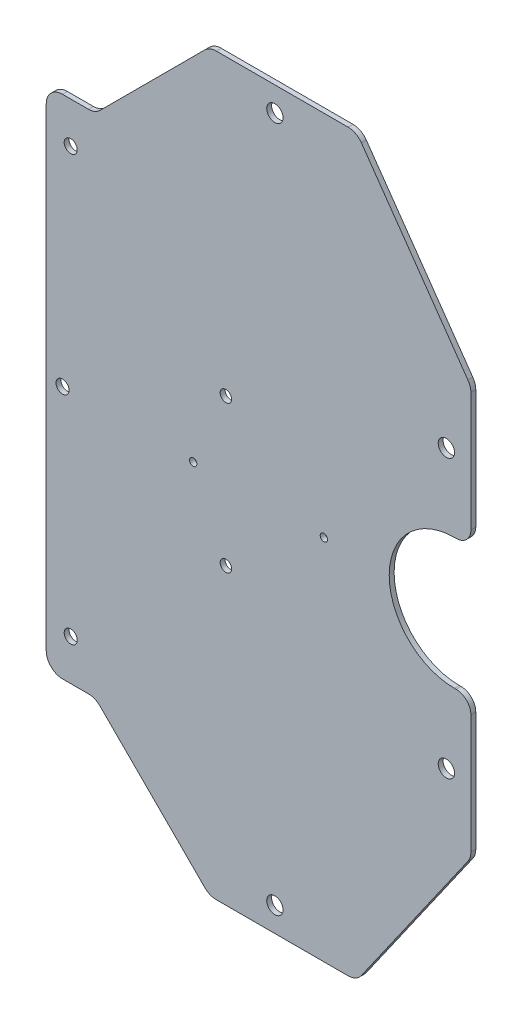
ISO-10303-21;
HEADER;
FILE_DESCRIPTION(('STEP AP214'),'2;1');
FILE_NAME('part.step','',(''),(''),'','','');
FILE_SCHEMA(('AUTOMOTIVE_DESIGN { 1 0 10303 214 1 1 1 1 }'));
ENDSEC;
DATA;
#1=APPLICATION_CONTEXT('core data for automotive mechanical design processes');
#2=APPLICATION_PROTOCOL_DEFINITION('international standard','automotive_design',2000,#1);
#3=PRODUCT_CONTEXT('',#1,'mechanical');
#4=PRODUCT('Part','Part','',(#3));
#5=PRODUCT_RELATED_PRODUCT_CATEGORY('part','',(#4));
#6=PRODUCT_DEFINITION_FORMATION('','',#4);
#7=PRODUCT_DEFINITION_CONTEXT('part definition',#1,'design');
#8=PRODUCT_DEFINITION('design','',#6,#7);
#9=PRODUCT_DEFINITION_SHAPE('','',#8);
#10=(LENGTH_UNIT() NAMED_UNIT(*) SI_UNIT(.MILLI.,.METRE.));
#11=(NAMED_UNIT(*) PLANE_ANGLE_UNIT() SI_UNIT($,.RADIAN.));
#12=(NAMED_UNIT(*) SI_UNIT($,.STERADIAN.) SOLID_ANGLE_UNIT());
#13=UNCERTAINTY_MEASURE_WITH_UNIT(LENGTH_MEASURE(1.E-05),#10,'distance_accuracy_value','');
#14=(GEOMETRIC_REPRESENTATION_CONTEXT(3) GLOBAL_UNCERTAINTY_ASSIGNED_CONTEXT((#13)) GLOBAL_UNIT_ASSIGNED_CONTEXT((#10,
#11,#12)) REPRESENTATION_CONTEXT('',''));
#15=CARTESIAN_POINT('',(0.,0.,0.));
#16=DIRECTION('',(0.,0.,1.));
#17=DIRECTION('',(1.,0.,0.));
#18=AXIS2_PLACEMENT_3D('',#15,#16,#17);
#19=CARTESIAN_POINT('',(-62.2065556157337,215.,3.));
#20=DIRECTION('',(0.,0.,1.));
#21=DIRECTION('',(1.,0.,0.));
#22=AXIS2_PLACEMENT_3D('',#19,#20,#21);
#23=PLANE('',#22);
#24=CARTESIAN_POINT('',(-157.,0.,3.));
#25=DIRECTION('',(0.,0.,1.));
#26=DIRECTION('',(1.,0.,0.));
#27=AXIS2_PLACEMENT_3D('',#24,#25,#26);
#28=CIRCLE('',#27,2.25000000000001);
#29=CARTESIAN_POINT('',(-154.75,0.,3.));
#30=VERTEX_POINT('',#29);
#31=EDGE_CURVE('E863',#30,#30,#28,.T.);
#32=ORIENTED_EDGE('',*,*,#31,.F.);
#33=EDGE_LOOP('',(#32));
#34=FACE_BOUND('',#33,.T.);
#35=CARTESIAN_POINT('',(-232.,130.,3.));
#36=DIRECTION('',(0.,0.,1.));
#37=DIRECTION('',(1.,0.,0.));
#38=AXIS2_PLACEMENT_3D('',#35,#36,#37);
#39=CIRCLE('',#38,3.99999999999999);
#40=CARTESIAN_POINT('',(-228.,130.,3.));
#41=VERTEX_POINT('',#40);
#42=EDGE_CURVE('E875',#41,#41,#39,.T.);
#43=ORIENTED_EDGE('',*,*,#42,.F.);
#44=EDGE_LOOP('',(#43));
#45=FACE_BOUND('',#44,.T.);
#46=CARTESIAN_POINT('',(-137.,45.,3.));
#47=DIRECTION('',(0.,0.,1.));
#48=DIRECTION('',(1.,0.,0.));
#49=AXIS2_PLACEMENT_3D('',#46,#47,#48);
#50=CIRCLE('',#49,3.49999999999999);
#51=CARTESIAN_POINT('',(-133.5,45.,3.));
#52=VERTEX_POINT('',#51);
#53=EDGE_CURVE('E887',#52,#52,#50,.T.);
#54=ORIENTED_EDGE('',*,*,#53,.F.);
#55=EDGE_LOOP('',(#54));
#56=FACE_BOUND('',#55,.T.);
#57=CARTESIAN_POINT('',(-1.99999999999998,-85.,3.));
#58=DIRECTION('',(0.,0.,1.));
#59=DIRECTION('',(1.,0.,0.));
#60=AXIS2_PLACEMENT_3D('',#57,#58,#59);
#61=CIRCLE('',#60,5.);
#62=CARTESIAN_POINT('',(3.00000000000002,-85.,3.));
#63=VERTEX_POINT('',#62);
#64=EDGE_CURVE('E899',#63,#63,#61,.T.);
#65=ORIENTED_EDGE('',*,*,#64,.F.);
#66=EDGE_LOOP('',(#65));
#67=FACE_BOUND('',#66,.T.);
#68=CARTESIAN_POINT('',(-107.,210.,3.));
#69=DIRECTION('',(0.,0.,1.));
#70=DIRECTION('',(1.,0.,0.));
#71=AXIS2_PLACEMENT_3D('',#68,#69,#70);
#72=CIRCLE('',#71,5.00000000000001);
#73=CARTESIAN_POINT('',(-102.,210.,3.));
#74=VERTEX_POINT('',#73);
#75=EDGE_CURVE('E911',#74,#74,#72,.T.);
#76=ORIENTED_EDGE('',*,*,#75,.F.);
#77=EDGE_LOOP('',(#76));
#78=FACE_BOUND('',#77,.T.);
#79=CARTESIAN_POINT('',(-62.2065556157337,215.,3.));
#80=DIRECTION('',(0.,0.,1.));
#81=DIRECTION('',(1.,0.,0.));
#82=AXIS2_PLACEMENT_3D('',#79,#80,#81);
#83=CIRCLE('',#82,10.);
#84=CARTESIAN_POINT('',(-54.0142364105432,220.734623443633,3.));
#85=VERTEX_POINT('',#84);
#86=CARTESIAN_POINT('',(-62.2065556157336,225.,3.));
#87=VERTEX_POINT('',#86);
#88=EDGE_CURVE('E294',#85,#87,#83,.T.);
#89=ORIENTED_EDGE('',*,*,#88,.T.);
#90=DIRECTION('',(1.,0.,0.));
#91=VECTOR('',#90,1.);
#92=CARTESIAN_POINT('',(-142.857864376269,225.,3.));
#93=LINE('',#92,#91);
#94=CARTESIAN_POINT('',(-142.857864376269,225.,3.));
#95=VERTEX_POINT('',#94);
#96=EDGE_CURVE('E211',#95,#87,#93,.T.);
#97=ORIENTED_EDGE('',*,*,#96,.F.);
#98=CARTESIAN_POINT('',(-142.857864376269,215.,3.));
#99=DIRECTION('',(0.,0.,1.));
#100=DIRECTION('',(1.,0.,0.));
#101=AXIS2_PLACEMENT_3D('',#98,#99,#100);
#102=CIRCLE('',#101,10.);
#103=CARTESIAN_POINT('',(-149.928932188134,222.071067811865,3.));
#104=VERTEX_POINT('',#103);
#105=EDGE_CURVE('E297',#95,#104,#102,.T.);
#106=ORIENTED_EDGE('',*,*,#105,.T.);
#107=DIRECTION('',(-0.707106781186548,-0.707106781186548,0.));
#108=VECTOR('',#107,1.);
#109=CARTESIAN_POINT('',(-149.928932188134,222.071067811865,3.));
#110=LINE('',#109,#108);
#111=CARTESIAN_POINT('',(-214.071067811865,157.928932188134,3.));
#112=VERTEX_POINT('',#111);
#113=EDGE_CURVE('E299',#104,#112,#110,.T.);
#114=ORIENTED_EDGE('',*,*,#113,.T.);
#115=CARTESIAN_POINT('',(-221.142135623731,165.,3.));
#116=DIRECTION('',(0.,0.,1.));
#117=DIRECTION('',(1.,0.,0.));
#118=AXIS2_PLACEMENT_3D('',#115,#116,#117);
#119=CIRCLE('',#118,10.);
#120=CARTESIAN_POINT('',(-221.142135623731,155.,3.));
#121=VERTEX_POINT('',#120);
#122=EDGE_CURVE('E301',#121,#112,#119,.T.);
#123=ORIENTED_EDGE('',*,*,#122,.F.);
#124=DIRECTION('',(-1.,0.,0.));
#125=VECTOR('',#124,1.);
#126=CARTESIAN_POINT('',(-221.142135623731,155.,3.));
#127=LINE('',#126,#125);
#128=CARTESIAN_POINT('',(-237.,155.,3.));
#129=VERTEX_POINT('',#128);
#130=EDGE_CURVE('E304',#121,#129,#127,.T.);
#131=ORIENTED_EDGE('',*,*,#130,.T.);
#132=CARTESIAN_POINT('',(-237.,145.,3.));
#133=DIRECTION('',(0.,0.,-1.));
#134=DIRECTION('',(-1.,0.,0.));
#135=AXIS2_PLACEMENT_3D('',#132,#133,#134);
#136=CIRCLE('',#135,10.);
#137=CARTESIAN_POINT('',(-247.,145.,3.));
#138=VERTEX_POINT('',#137);
#139=EDGE_CURVE('E306',#138,#129,#136,.T.);
#140=ORIENTED_EDGE('',*,*,#139,.F.);
#141=DIRECTION('',(0.,-1.,0.));
#142=VECTOR('',#141,1.);
#143=CARTESIAN_POINT('',(-247.,145.,3.));
#144=LINE('',#143,#142);
#145=CARTESIAN_POINT('',(-247.,-145.,3.));
#146=VERTEX_POINT('',#145);
#147=EDGE_CURVE('E309',#138,#146,#144,.T.);
#148=ORIENTED_EDGE('',*,*,#147,.T.);
#149=CARTESIAN_POINT('',(-237.,-145.,3.));
#150=DIRECTION('',(0.,0.,1.));
#151=DIRECTION('',(1.,0.,0.));
#152=AXIS2_PLACEMENT_3D('',#149,#150,#151);
#153=CIRCLE('',#152,10.);
#154=CARTESIAN_POINT('',(-237.,-155.,3.));
#155=VERTEX_POINT('',#154);
#156=EDGE_CURVE('E311',#146,#155,#153,.T.);
#157=ORIENTED_EDGE('',*,*,#156,.T.);
#158=DIRECTION('',(-1.,0.,0.));
#159=VECTOR('',#158,1.);
#160=CARTESIAN_POINT('',(-221.142135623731,-155.,3.));
#161=LINE('',#160,#159);
#162=CARTESIAN_POINT('',(-221.142135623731,-155.,3.));
#163=VERTEX_POINT('',#162);
#164=EDGE_CURVE('E313',#163,#155,#161,.T.);
#165=ORIENTED_EDGE('',*,*,#164,.F.);
#166=CARTESIAN_POINT('',(-221.142135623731,-165.,3.));
#167=DIRECTION('',(0.,0.,1.));
#168=DIRECTION('',(1.,0.,0.));
#169=AXIS2_PLACEMENT_3D('',#166,#167,#168);
#170=CIRCLE('',#169,10.);
#171=CARTESIAN_POINT('',(-214.071067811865,-157.928932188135,3.));
#172=VERTEX_POINT('',#171);
#173=EDGE_CURVE('E316',#172,#163,#170,.T.);
#174=ORIENTED_EDGE('',*,*,#173,.F.);
#175=DIRECTION('',(0.707106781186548,-0.707106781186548,0.));
#176=VECTOR('',#175,1.);
#177=CARTESIAN_POINT('',(-214.071067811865,-157.928932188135,3.));
#178=LINE('',#177,#176);
#179=CARTESIAN_POINT('',(-149.928932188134,-222.071067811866,3.));
#180=VERTEX_POINT('',#179);
#181=EDGE_CURVE('E319',#172,#180,#178,.T.);
#182=ORIENTED_EDGE('',*,*,#181,.T.);
#183=CARTESIAN_POINT('',(-142.857864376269,-215.,3.));
#184=DIRECTION('',(0.,0.,-1.));
#185=DIRECTION('',(-1.,0.,0.));
#186=AXIS2_PLACEMENT_3D('',#183,#184,#185);
#187=CIRCLE('',#186,9.99999999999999);
#188=CARTESIAN_POINT('',(-142.857864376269,-225.,3.));
#189=VERTEX_POINT('',#188);
#190=EDGE_CURVE('E321',#189,#180,#187,.T.);
#191=ORIENTED_EDGE('',*,*,#190,.F.);
#192=DIRECTION('',(1.,0.,0.));
#193=VECTOR('',#192,1.);
#194=CARTESIAN_POINT('',(-142.857864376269,-225.,3.));
#195=LINE('',#194,#193);
#196=CARTESIAN_POINT('',(-62.2065556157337,-225.,3.));
#197=VERTEX_POINT('',#196);
#198=EDGE_CURVE('E324',#189,#197,#195,.T.);
#199=ORIENTED_EDGE('',*,*,#198,.T.);
#200=CARTESIAN_POINT('',(-62.2065556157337,-215.,3.));
#201=DIRECTION('',(0.,0.,1.));
#202=DIRECTION('',(1.,0.,0.));
#203=AXIS2_PLACEMENT_3D('',#200,#201,#202);
#204=CIRCLE('',#203,9.99999999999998);
#205=CARTESIAN_POINT('',(-54.0142364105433,-220.734623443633,3.));
#206=VERTEX_POINT('',#205);
#207=EDGE_CURVE('E326',#197,#206,#204,.T.);
#208=ORIENTED_EDGE('',*,*,#207,.T.);
#209=DIRECTION('',(-0.573462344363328,-0.81923192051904,0.));
#210=VECTOR('',#209,1.);
#211=CARTESIAN_POINT('',(11.1923192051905,-127.582401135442,3.));
#212=LINE('',#211,#210);
#213=CARTESIAN_POINT('',(11.1923192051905,-127.582401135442,3.));
#214=VERTEX_POINT('',#213);
#215=EDGE_CURVE('E328',#214,#206,#212,.T.);
#216=ORIENTED_EDGE('',*,*,#215,.F.);
#217=CARTESIAN_POINT('',(3.00000000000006,-121.847777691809,3.));
#218=DIRECTION('',(0.,0.,1.));
#219=DIRECTION('',(1.,0.,0.));
#220=AXIS2_PLACEMENT_3D('',#217,#218,#219);
#221=CIRCLE('',#220,9.99999999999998);
#222=CARTESIAN_POINT('',(13.0000000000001,-121.847777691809,3.));
#223=VERTEX_POINT('',#222);
#224=EDGE_CURVE('E331',#214,#223,#221,.T.);
#225=ORIENTED_EDGE('',*,*,#224,.T.);
#226=DIRECTION('',(0.,-1.,0.));
#227=VECTOR('',#226,1.);
#228=CARTESIAN_POINT('',(13.0000000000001,-49.,3.));
#229=LINE('',#228,#227);
#230=CARTESIAN_POINT('',(13.0000000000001,-49.,3.));
#231=VERTEX_POINT('',#230);
#232=EDGE_CURVE('E333',#231,#223,#229,.T.);
#233=ORIENTED_EDGE('',*,*,#232,.F.);
#234=CARTESIAN_POINT('',(4.00000000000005,-49.,3.));
#235=DIRECTION('',(0.,0.,1.));
#236=DIRECTION('',(1.,0.,0.));
#237=AXIS2_PLACEMENT_3D('',#234,#235,#236);
#238=CIRCLE('',#237,9.);
#239=CARTESIAN_POINT('',(4.00000000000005,-40.,3.));
#240=VERTEX_POINT('',#239);
#241=EDGE_CURVE('E336',#231,#240,#238,.T.);
#242=ORIENTED_EDGE('',*,*,#241,.T.);
#243=DIRECTION('',(1.,0.,0.));
#244=VECTOR('',#243,1.);
#245=CARTESIAN_POINT('',(3.00000000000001,-40.,3.));
#246=LINE('',#245,#244);
#247=CARTESIAN_POINT('',(3.,-40.,3.));
#248=VERTEX_POINT('',#247);
#249=EDGE_CURVE('E338',#248,#240,#246,.T.);
#250=ORIENTED_EDGE('',*,*,#249,.F.);
#251=CARTESIAN_POINT('',(3.00000000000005,0.,3.));
#252=DIRECTION('',(0.,0.,1.));
#253=DIRECTION('',(1.,0.,0.));
#254=AXIS2_PLACEMENT_3D('',#251,#252,#253);
#255=CIRCLE('',#254,40.);
#256=CARTESIAN_POINT('',(3.00000000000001,40.,3.));
#257=VERTEX_POINT('',#256);
#258=EDGE_CURVE('E341',#257,#248,#255,.T.);
#259=ORIENTED_EDGE('',*,*,#258,.F.);
#260=DIRECTION('',(1.,0.,0.));
#261=VECTOR('',#260,1.);
#262=CARTESIAN_POINT('',(3.00000000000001,40.,3.));
#263=LINE('',#262,#261);
#264=CARTESIAN_POINT('',(4.00000000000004,40.,3.));
#265=VERTEX_POINT('',#264);
#266=EDGE_CURVE('E344',#257,#265,#263,.T.);
#267=ORIENTED_EDGE('',*,*,#266,.T.);
#268=CARTESIAN_POINT('',(4.00000000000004,49.,3.));
#269=DIRECTION('',(0.,0.,-1.));
#270=DIRECTION('',(-1.,0.,0.));
#271=AXIS2_PLACEMENT_3D('',#268,#269,#270);
#272=CIRCLE('',#271,9.);
#273=CARTESIAN_POINT('',(13.,49.,3.));
#274=VERTEX_POINT('',#273);
#275=EDGE_CURVE('E346',#274,#265,#272,.T.);
#276=ORIENTED_EDGE('',*,*,#275,.F.);
#277=DIRECTION('',(0.,-1.,0.));
#278=VECTOR('',#277,1.);
#279=CARTESIAN_POINT('',(13.0000000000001,121.847777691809,3.));
#280=LINE('',#279,#278);
#281=CARTESIAN_POINT('',(13.0000000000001,121.847777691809,3.));
#282=VERTEX_POINT('',#281);
#283=EDGE_CURVE('E349',#282,#274,#280,.T.);
#284=ORIENTED_EDGE('',*,*,#283,.F.);
#285=CARTESIAN_POINT('',(3.00000000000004,121.847777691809,3.));
#286=DIRECTION('',(0.,0.,1.));
#287=DIRECTION('',(1.,0.,0.));
#288=AXIS2_PLACEMENT_3D('',#285,#286,#287);
#289=CIRCLE('',#288,10.0000000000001);
#290=CARTESIAN_POINT('',(11.1923192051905,127.582401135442,3.));
#291=VERTEX_POINT('',#290);
#292=EDGE_CURVE('E53',#282,#291,#289,.T.);
#293=ORIENTED_EDGE('',*,*,#292,.T.);
#294=DIRECTION('',(0.573462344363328,-0.81923192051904,0.));
#295=VECTOR('',#294,1.);
#296=CARTESIAN_POINT('',(-54.0142364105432,220.734623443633,3.));
#297=LINE('',#296,#295);
#298=EDGE_CURVE('E353',#85,#291,#297,.T.);
#299=ORIENTED_EDGE('',*,*,#298,.F.);
#300=EDGE_LOOP('',(#89,#97,#106,#114,#123,#131,#140,#148,#157,#165,#174,#182,#191,#199,#208,
#216,#225,#233,#242,#250,#259,#267,#276,#284,#293,#299));
#301=FACE_BOUND('',#300,.T.);
#302=CARTESIAN_POINT('',(-232.,-130.,3.));
#303=DIRECTION('',(0.,0.,1.));
#304=DIRECTION('',(1.,0.,0.));
#305=AXIS2_PLACEMENT_3D('',#302,#303,#304);
#306=CIRCLE('',#305,3.99999999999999);
#307=CARTESIAN_POINT('',(-228.,-130.,3.));
#308=VERTEX_POINT('',#307);
#309=EDGE_CURVE('E217',#308,#308,#306,.T.);
#310=ORIENTED_EDGE('',*,*,#309,.F.);
#311=EDGE_LOOP('',(#310));
#312=FACE_BOUND('',#311,.T.);
#313=CARTESIAN_POINT('',(-107.,-210.,3.));
#314=DIRECTION('',(0.,0.,1.));
#315=DIRECTION('',(1.,0.,0.));
#316=AXIS2_PLACEMENT_3D('',#313,#314,#315);
#317=CIRCLE('',#316,5.00000000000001);
#318=CARTESIAN_POINT('',(-102.,-210.,3.));
#319=VERTEX_POINT('',#318);
#320=EDGE_CURVE('E905',#319,#319,#317,.T.);
#321=ORIENTED_EDGE('',*,*,#320,.F.);
#322=EDGE_LOOP('',(#321));
#323=FACE_BOUND('',#322,.T.);
#324=CARTESIAN_POINT('',(-1.99999999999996,85.,3.));
#325=DIRECTION('',(0.,0.,1.));
#326=DIRECTION('',(1.,0.,0.));
#327=AXIS2_PLACEMENT_3D('',#324,#325,#326);
#328=CIRCLE('',#327,5.);
#329=CARTESIAN_POINT('',(3.00000000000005,85.,3.));
#330=VERTEX_POINT('',#329);
#331=EDGE_CURVE('E893',#330,#330,#328,.T.);
#332=ORIENTED_EDGE('',*,*,#331,.F.);
#333=EDGE_LOOP('',(#332));
#334=FACE_BOUND('',#333,.T.);
#335=CARTESIAN_POINT('',(-137.,-45.,3.));
#336=DIRECTION('',(0.,0.,1.));
#337=DIRECTION('',(1.,0.,0.));
#338=AXIS2_PLACEMENT_3D('',#335,#336,#337);
#339=CIRCLE('',#338,3.49999999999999);
#340=CARTESIAN_POINT('',(-133.5,-45.,3.));
#341=VERTEX_POINT('',#340);
#342=EDGE_CURVE('E881',#341,#341,#339,.T.);
#343=ORIENTED_EDGE('',*,*,#342,.F.);
#344=EDGE_LOOP('',(#343));
#345=FACE_BOUND('',#344,.T.);
#346=CARTESIAN_POINT('',(-237.,0.,3.));
#347=DIRECTION('',(0.,0.,1.));
#348=DIRECTION('',(1.,0.,0.));
#349=AXIS2_PLACEMENT_3D('',#346,#347,#348);
#350=CIRCLE('',#349,3.99999999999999);
#351=CARTESIAN_POINT('',(-233.,0.,3.));
#352=VERTEX_POINT('',#351);
#353=EDGE_CURVE('E869',#352,#352,#350,.T.);
#354=ORIENTED_EDGE('',*,*,#353,.F.);
#355=EDGE_LOOP('',(#354));
#356=FACE_BOUND('',#355,.T.);
#357=CARTESIAN_POINT('',(-76.9999999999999,0.,3.));
#358=DIRECTION('',(0.,0.,1.));
#359=DIRECTION('',(1.,0.,0.));
#360=AXIS2_PLACEMENT_3D('',#357,#358,#359);
#361=CIRCLE('',#360,2.25);
#362=CARTESIAN_POINT('',(-74.7499999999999,0.,3.));
#363=VERTEX_POINT('',#362);
#364=EDGE_CURVE('E852',#363,#363,#361,.T.);
#365=ORIENTED_EDGE('',*,*,#364,.F.);
#366=EDGE_LOOP('',(#365));
#367=FACE_BOUND('',#366,.T.);
#368=ADVANCED_FACE('F30',(#34,#45,#56,#67,#78,#301,#312,#323,#334,#345,#356,#367),#23,.T.);
#369=CARTESIAN_POINT('',(-62.2065556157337,215.,0.));
#370=DIRECTION('',(0.,0.,1.));
#371=DIRECTION('',(1.,0.,0.));
#372=AXIS2_PLACEMENT_3D('',#369,#370,#371);
#373=PLANE('',#372);
#374=CARTESIAN_POINT('',(-157.,0.,0.));
#375=DIRECTION('',(0.,0.,1.));
#376=DIRECTION('',(1.,0.,0.));
#377=AXIS2_PLACEMENT_3D('',#374,#375,#376);
#378=CIRCLE('',#377,2.25000000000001);
#379=CARTESIAN_POINT('',(-154.75,0.,0.));
#380=VERTEX_POINT('',#379);
#381=EDGE_CURVE('E858',#380,#380,#378,.T.);
#382=ORIENTED_EDGE('',*,*,#381,.T.);
#383=EDGE_LOOP('',(#382));
#384=FACE_BOUND('',#383,.T.);
#385=CARTESIAN_POINT('',(-232.,130.,0.));
#386=DIRECTION('',(0.,0.,1.));
#387=DIRECTION('',(1.,0.,0.));
#388=AXIS2_PLACEMENT_3D('',#385,#386,#387);
#389=CIRCLE('',#388,3.99999999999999);
#390=CARTESIAN_POINT('',(-228.,130.,0.));
#391=VERTEX_POINT('',#390);
#392=EDGE_CURVE('E872',#391,#391,#389,.T.);
#393=ORIENTED_EDGE('',*,*,#392,.T.);
#394=EDGE_LOOP('',(#393));
#395=FACE_BOUND('',#394,.T.);
#396=CARTESIAN_POINT('',(-137.,45.,0.));
#397=DIRECTION('',(0.,0.,1.));
#398=DIRECTION('',(1.,0.,0.));
#399=AXIS2_PLACEMENT_3D('',#396,#397,#398);
#400=CIRCLE('',#399,3.49999999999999);
#401=CARTESIAN_POINT('',(-133.5,45.,0.));
#402=VERTEX_POINT('',#401);
#403=EDGE_CURVE('E884',#402,#402,#400,.T.);
#404=ORIENTED_EDGE('',*,*,#403,.T.);
#405=EDGE_LOOP('',(#404));
#406=FACE_BOUND('',#405,.T.);
#407=CARTESIAN_POINT('',(-1.99999999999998,-85.,0.));
#408=DIRECTION('',(0.,0.,1.));
#409=DIRECTION('',(1.,0.,0.));
#410=AXIS2_PLACEMENT_3D('',#407,#408,#409);
#411=CIRCLE('',#410,5.);
#412=CARTESIAN_POINT('',(3.00000000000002,-85.,0.));
#413=VERTEX_POINT('',#412);
#414=EDGE_CURVE('E896',#413,#413,#411,.T.);
#415=ORIENTED_EDGE('',*,*,#414,.T.);
#416=EDGE_LOOP('',(#415));
#417=FACE_BOUND('',#416,.T.);
#418=CARTESIAN_POINT('',(-107.,210.,0.));
#419=DIRECTION('',(0.,0.,1.));
#420=DIRECTION('',(1.,0.,0.));
#421=AXIS2_PLACEMENT_3D('',#418,#419,#420);
#422=CIRCLE('',#421,5.00000000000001);
#423=CARTESIAN_POINT('',(-102.,210.,0.));
#424=VERTEX_POINT('',#423);
#425=EDGE_CURVE('E908',#424,#424,#422,.T.);
#426=ORIENTED_EDGE('',*,*,#425,.T.);
#427=EDGE_LOOP('',(#426));
#428=FACE_BOUND('',#427,.T.);
#429=CARTESIAN_POINT('',(-62.2065556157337,215.,0.));
#430=DIRECTION('',(0.,0.,1.));
#431=DIRECTION('',(1.,0.,0.));
#432=AXIS2_PLACEMENT_3D('',#429,#430,#431);
#433=CIRCLE('',#432,10.);
#434=CARTESIAN_POINT('',(-54.0142364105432,220.734623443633,0.));
#435=VERTEX_POINT('',#434);
#436=CARTESIAN_POINT('',(-62.2065556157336,225.,0.));
#437=VERTEX_POINT('',#436);
#438=EDGE_CURVE('E214',#435,#437,#433,.T.);
#439=ORIENTED_EDGE('',*,*,#438,.F.);
#440=DIRECTION('',(0.573462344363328,-0.81923192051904,0.));
#441=VECTOR('',#440,1.);
#442=CARTESIAN_POINT('',(-54.0142364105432,220.734623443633,0.));
#443=LINE('',#442,#441);
#444=CARTESIAN_POINT('',(11.1923192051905,127.582401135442,0.));
#445=VERTEX_POINT('',#444);
#446=EDGE_CURVE('E292',#435,#445,#443,.T.);
#447=ORIENTED_EDGE('',*,*,#446,.T.);
#448=CARTESIAN_POINT('',(3.00000000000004,121.847777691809,0.));
#449=DIRECTION('',(0.,0.,1.));
#450=DIRECTION('',(1.,0.,0.));
#451=AXIS2_PLACEMENT_3D('',#448,#449,#450);
#452=CIRCLE('',#451,10.0000000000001);
#453=CARTESIAN_POINT('',(13.0000000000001,121.847777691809,0.));
#454=VERTEX_POINT('',#453);
#455=EDGE_CURVE('E289',#454,#445,#452,.T.);
#456=ORIENTED_EDGE('',*,*,#455,.F.);
#457=DIRECTION('',(0.,-1.,0.));
#458=VECTOR('',#457,1.);
#459=CARTESIAN_POINT('',(13.0000000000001,121.847777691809,0.));
#460=LINE('',#459,#458);
#461=CARTESIAN_POINT('',(13.,49.,0.));
#462=VERTEX_POINT('',#461);
#463=EDGE_CURVE('E286',#454,#462,#460,.T.);
#464=ORIENTED_EDGE('',*,*,#463,.T.);
#465=CARTESIAN_POINT('',(4.00000000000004,49.,0.));
#466=DIRECTION('',(0.,0.,-1.));
#467=DIRECTION('',(-1.,0.,0.));
#468=AXIS2_PLACEMENT_3D('',#465,#466,#467);
#469=CIRCLE('',#468,9.);
#470=CARTESIAN_POINT('',(4.00000000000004,40.,0.));
#471=VERTEX_POINT('',#470);
#472=EDGE_CURVE('E283',#462,#471,#469,.T.);
#473=ORIENTED_EDGE('',*,*,#472,.T.);
#474=DIRECTION('',(1.,0.,0.));
#475=VECTOR('',#474,1.);
#476=CARTESIAN_POINT('',(3.00000000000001,40.,0.));
#477=LINE('',#476,#475);
#478=CARTESIAN_POINT('',(3.00000000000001,40.,0.));
#479=VERTEX_POINT('',#478);
#480=EDGE_CURVE('E280',#479,#471,#477,.T.);
#481=ORIENTED_EDGE('',*,*,#480,.F.);
#482=CARTESIAN_POINT('',(3.00000000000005,0.,0.));
#483=DIRECTION('',(0.,0.,1.));
#484=DIRECTION('',(1.,0.,0.));
#485=AXIS2_PLACEMENT_3D('',#482,#483,#484);
#486=CIRCLE('',#485,40.);
#487=CARTESIAN_POINT('',(3.,-40.,0.));
#488=VERTEX_POINT('',#487);
#489=EDGE_CURVE('E277',#479,#488,#486,.T.);
#490=ORIENTED_EDGE('',*,*,#489,.T.);
#491=DIRECTION('',(1.,0.,0.));
#492=VECTOR('',#491,1.);
#493=CARTESIAN_POINT('',(3.00000000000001,-40.,0.));
#494=LINE('',#493,#492);
#495=CARTESIAN_POINT('',(4.00000000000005,-40.,0.));
#496=VERTEX_POINT('',#495);
#497=EDGE_CURVE('E274',#488,#496,#494,.T.);
#498=ORIENTED_EDGE('',*,*,#497,.T.);
#499=CARTESIAN_POINT('',(4.00000000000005,-49.,0.));
#500=DIRECTION('',(0.,0.,1.));
#501=DIRECTION('',(1.,0.,0.));
#502=AXIS2_PLACEMENT_3D('',#499,#500,#501);
#503=CIRCLE('',#502,9.);
#504=CARTESIAN_POINT('',(13.0000000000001,-49.,0.));
#505=VERTEX_POINT('',#504);
#506=EDGE_CURVE('E271',#505,#496,#503,.T.);
#507=ORIENTED_EDGE('',*,*,#506,.F.);
#508=DIRECTION('',(0.,-1.,0.));
#509=VECTOR('',#508,1.);
#510=CARTESIAN_POINT('',(13.0000000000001,-49.,0.));
#511=LINE('',#510,#509);
#512=CARTESIAN_POINT('',(13.0000000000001,-121.847777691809,0.));
#513=VERTEX_POINT('',#512);
#514=EDGE_CURVE('E268',#505,#513,#511,.T.);
#515=ORIENTED_EDGE('',*,*,#514,.T.);
#516=CARTESIAN_POINT('',(3.00000000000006,-121.847777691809,0.));
#517=DIRECTION('',(0.,0.,1.));
#518=DIRECTION('',(1.,0.,0.));
#519=AXIS2_PLACEMENT_3D('',#516,#517,#518);
#520=CIRCLE('',#519,9.99999999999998);
#521=CARTESIAN_POINT('',(11.1923192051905,-127.582401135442,0.));
#522=VERTEX_POINT('',#521);
#523=EDGE_CURVE('E265',#522,#513,#520,.T.);
#524=ORIENTED_EDGE('',*,*,#523,.F.);
#525=DIRECTION('',(-0.573462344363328,-0.81923192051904,0.));
#526=VECTOR('',#525,1.);
#527=CARTESIAN_POINT('',(11.1923192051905,-127.582401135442,0.));
#528=LINE('',#527,#526);
#529=CARTESIAN_POINT('',(-54.0142364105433,-220.734623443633,0.));
#530=VERTEX_POINT('',#529);
#531=EDGE_CURVE('E262',#522,#530,#528,.T.);
#532=ORIENTED_EDGE('',*,*,#531,.T.);
#533=CARTESIAN_POINT('',(-62.2065556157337,-215.,0.));
#534=DIRECTION('',(0.,0.,1.));
#535=DIRECTION('',(1.,0.,0.));
#536=AXIS2_PLACEMENT_3D('',#533,#534,#535);
#537=CIRCLE('',#536,9.99999999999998);
#538=CARTESIAN_POINT('',(-62.2065556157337,-225.,0.));
#539=VERTEX_POINT('',#538);
#540=EDGE_CURVE('E259',#539,#530,#537,.T.);
#541=ORIENTED_EDGE('',*,*,#540,.F.);
#542=DIRECTION('',(1.,0.,0.));
#543=VECTOR('',#542,1.);
#544=CARTESIAN_POINT('',(-142.857864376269,-225.,0.));
#545=LINE('',#544,#543);
#546=CARTESIAN_POINT('',(-142.857864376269,-225.,0.));
#547=VERTEX_POINT('',#546);
#548=EDGE_CURVE('E257',#547,#539,#545,.T.);
#549=ORIENTED_EDGE('',*,*,#548,.F.);
#550=CARTESIAN_POINT('',(-142.857864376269,-215.,0.));
#551=DIRECTION('',(0.,0.,-1.));
#552=DIRECTION('',(-1.,0.,0.));
#553=AXIS2_PLACEMENT_3D('',#550,#551,#552);
#554=CIRCLE('',#553,9.99999999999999);
#555=CARTESIAN_POINT('',(-149.928932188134,-222.071067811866,0.));
#556=VERTEX_POINT('',#555);
#557=EDGE_CURVE('E254',#547,#556,#554,.T.);
#558=ORIENTED_EDGE('',*,*,#557,.T.);
#559=DIRECTION('',(0.707106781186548,-0.707106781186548,0.));
#560=VECTOR('',#559,1.);
#561=CARTESIAN_POINT('',(-214.071067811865,-157.928932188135,0.));
#562=LINE('',#561,#560);
#563=CARTESIAN_POINT('',(-214.071067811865,-157.928932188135,0.));
#564=VERTEX_POINT('',#563);
#565=EDGE_CURVE('E251',#564,#556,#562,.T.);
#566=ORIENTED_EDGE('',*,*,#565,.F.);
#567=CARTESIAN_POINT('',(-221.142135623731,-165.,0.));
#568=DIRECTION('',(0.,0.,1.));
#569=DIRECTION('',(1.,0.,0.));
#570=AXIS2_PLACEMENT_3D('',#567,#568,#569);
#571=CIRCLE('',#570,10.);
#572=CARTESIAN_POINT('',(-221.142135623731,-155.,0.));
#573=VERTEX_POINT('',#572);
#574=EDGE_CURVE('E248',#564,#573,#571,.T.);
#575=ORIENTED_EDGE('',*,*,#574,.T.);
#576=DIRECTION('',(-1.,0.,0.));
#577=VECTOR('',#576,1.);
#578=CARTESIAN_POINT('',(-221.142135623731,-155.,0.));
#579=LINE('',#578,#577);
#580=CARTESIAN_POINT('',(-237.,-155.,0.));
#581=VERTEX_POINT('',#580);
#582=EDGE_CURVE('E245',#573,#581,#579,.T.);
#583=ORIENTED_EDGE('',*,*,#582,.T.);
#584=CARTESIAN_POINT('',(-237.,-145.,0.));
#585=DIRECTION('',(0.,0.,1.));
#586=DIRECTION('',(1.,0.,0.));
#587=AXIS2_PLACEMENT_3D('',#584,#585,#586);
#588=CIRCLE('',#587,10.);
#589=CARTESIAN_POINT('',(-247.,-145.,0.));
#590=VERTEX_POINT('',#589);
#591=EDGE_CURVE('E242',#590,#581,#588,.T.);
#592=ORIENTED_EDGE('',*,*,#591,.F.);
#593=DIRECTION('',(0.,1.,0.));
#594=VECTOR('',#593,1.);
#595=CARTESIAN_POINT('',(-247.,-145.,0.));
#596=LINE('',#595,#594);
#597=CARTESIAN_POINT('',(-247.,145.,0.));
#598=VERTEX_POINT('',#597);
#599=EDGE_CURVE('E240',#590,#598,#596,.T.);
#600=ORIENTED_EDGE('',*,*,#599,.T.);
#601=CARTESIAN_POINT('',(-237.,145.,0.));
#602=DIRECTION('',(0.,0.,-1.));
#603=DIRECTION('',(-1.,0.,0.));
#604=AXIS2_PLACEMENT_3D('',#601,#602,#603);
#605=CIRCLE('',#604,10.);
#606=CARTESIAN_POINT('',(-237.,155.,0.));
#607=VERTEX_POINT('',#606);
#608=EDGE_CURVE('E237',#598,#607,#605,.T.);
#609=ORIENTED_EDGE('',*,*,#608,.T.);
#610=DIRECTION('',(-1.,0.,0.));
#611=VECTOR('',#610,1.);
#612=CARTESIAN_POINT('',(-221.142135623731,155.,0.));
#613=LINE('',#612,#611);
#614=CARTESIAN_POINT('',(-221.142135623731,155.,0.));
#615=VERTEX_POINT('',#614);
#616=EDGE_CURVE('E234',#615,#607,#613,.T.);
#617=ORIENTED_EDGE('',*,*,#616,.F.);
#618=CARTESIAN_POINT('',(-221.142135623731,165.,0.));
#619=DIRECTION('',(0.,0.,1.));
#620=DIRECTION('',(1.,0.,0.));
#621=AXIS2_PLACEMENT_3D('',#618,#619,#620);
#622=CIRCLE('',#621,10.);
#623=CARTESIAN_POINT('',(-214.071067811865,157.928932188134,0.));
#624=VERTEX_POINT('',#623);
#625=EDGE_CURVE('E231',#615,#624,#622,.T.);
#626=ORIENTED_EDGE('',*,*,#625,.T.);
#627=DIRECTION('',(-0.707106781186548,-0.707106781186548,0.));
#628=VECTOR('',#627,1.);
#629=CARTESIAN_POINT('',(-149.928932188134,222.071067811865,0.));
#630=LINE('',#629,#628);
#631=CARTESIAN_POINT('',(-149.928932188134,222.071067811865,0.));
#632=VERTEX_POINT('',#631);
#633=EDGE_CURVE('E225',#632,#624,#630,.T.);
#634=ORIENTED_EDGE('',*,*,#633,.F.);
#635=CARTESIAN_POINT('',(-142.857864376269,215.,0.));
#636=DIRECTION('',(0.,0.,1.));
#637=DIRECTION('',(1.,0.,0.));
#638=AXIS2_PLACEMENT_3D('',#635,#636,#637);
#639=CIRCLE('',#638,10.);
#640=CARTESIAN_POINT('',(-142.857864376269,225.,0.));
#641=VERTEX_POINT('',#640);
#642=EDGE_CURVE('E223',#641,#632,#639,.T.);
#643=ORIENTED_EDGE('',*,*,#642,.F.);
#644=DIRECTION('',(1.,0.,0.));
#645=VECTOR('',#644,1.);
#646=CARTESIAN_POINT('',(-142.857864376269,225.,0.));
#647=LINE('',#646,#645);
#648=EDGE_CURVE('E209',#641,#437,#647,.T.);
#649=ORIENTED_EDGE('',*,*,#648,.T.);
#650=EDGE_LOOP('',(#439,#447,#456,#464,#473,#481,#490,#498,#507,#515,#524,#532,#541,#549,#558,
#566,#575,#583,#592,#600,#609,#617,#626,#634,#643,#649));
#651=FACE_BOUND('',#650,.T.);
#652=CARTESIAN_POINT('',(-232.,-130.,0.));
#653=DIRECTION('',(0.,0.,1.));
#654=DIRECTION('',(1.,0.,0.));
#655=AXIS2_PLACEMENT_3D('',#652,#653,#654);
#656=CIRCLE('',#655,3.99999999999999);
#657=CARTESIAN_POINT('',(-228.,-130.,0.));
#658=VERTEX_POINT('',#657);
#659=EDGE_CURVE('E914',#658,#658,#656,.T.);
#660=ORIENTED_EDGE('',*,*,#659,.T.);
#661=EDGE_LOOP('',(#660));
#662=FACE_BOUND('',#661,.T.);
#663=CARTESIAN_POINT('',(-107.,-210.,0.));
#664=DIRECTION('',(0.,0.,1.));
#665=DIRECTION('',(1.,0.,0.));
#666=AXIS2_PLACEMENT_3D('',#663,#664,#665);
#667=CIRCLE('',#666,5.00000000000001);
#668=CARTESIAN_POINT('',(-102.,-210.,0.));
#669=VERTEX_POINT('',#668);
#670=EDGE_CURVE('E902',#669,#669,#667,.T.);
#671=ORIENTED_EDGE('',*,*,#670,.T.);
#672=EDGE_LOOP('',(#671));
#673=FACE_BOUND('',#672,.T.);
#674=CARTESIAN_POINT('',(-1.99999999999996,85.,0.));
#675=DIRECTION('',(0.,0.,1.));
#676=DIRECTION('',(1.,0.,0.));
#677=AXIS2_PLACEMENT_3D('',#674,#675,#676);
#678=CIRCLE('',#677,5.);
#679=CARTESIAN_POINT('',(3.00000000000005,85.,0.));
#680=VERTEX_POINT('',#679);
#681=EDGE_CURVE('E890',#680,#680,#678,.T.);
#682=ORIENTED_EDGE('',*,*,#681,.T.);
#683=EDGE_LOOP('',(#682));
#684=FACE_BOUND('',#683,.T.);
#685=CARTESIAN_POINT('',(-137.,-45.,0.));
#686=DIRECTION('',(0.,0.,1.));
#687=DIRECTION('',(1.,0.,0.));
#688=AXIS2_PLACEMENT_3D('',#685,#686,#687);
#689=CIRCLE('',#688,3.49999999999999);
#690=CARTESIAN_POINT('',(-133.5,-45.,0.));
#691=VERTEX_POINT('',#690);
#692=EDGE_CURVE('E878',#691,#691,#689,.T.);
#693=ORIENTED_EDGE('',*,*,#692,.T.);
#694=EDGE_LOOP('',(#693));
#695=FACE_BOUND('',#694,.T.);
#696=CARTESIAN_POINT('',(-237.,0.,0.));
#697=DIRECTION('',(0.,0.,1.));
#698=DIRECTION('',(1.,0.,0.));
#699=AXIS2_PLACEMENT_3D('',#696,#697,#698);
#700=CIRCLE('',#699,3.99999999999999);
#701=CARTESIAN_POINT('',(-233.,0.,0.));
#702=VERTEX_POINT('',#701);
#703=EDGE_CURVE('E866',#702,#702,#700,.T.);
#704=ORIENTED_EDGE('',*,*,#703,.T.);
#705=EDGE_LOOP('',(#704));
#706=FACE_BOUND('',#705,.T.);
#707=CARTESIAN_POINT('',(-76.9999999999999,0.,0.));
#708=DIRECTION('',(0.,0.,1.));
#709=DIRECTION('',(1.,0.,0.));
#710=AXIS2_PLACEMENT_3D('',#707,#708,#709);
#711=CIRCLE('',#710,2.25);
#712=CARTESIAN_POINT('',(-74.7499999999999,0.,0.));
#713=VERTEX_POINT('',#712);
#714=EDGE_CURVE('E855',#713,#713,#711,.T.);
#715=ORIENTED_EDGE('',*,*,#714,.T.);
#716=EDGE_LOOP('',(#715));
#717=FACE_BOUND('',#716,.T.);
#718=ADVANCED_FACE('F220',(#384,#395,#406,#417,#428,#651,#662,#673,#684,#695,#706,#717),#373,.F.);
#719=CARTESIAN_POINT('',(-62.2065556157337,215.,3.));
#720=DIRECTION('',(0.,0.,-1.));
#721=DIRECTION('',(-1.,0.,0.));
#722=AXIS2_PLACEMENT_3D('',#719,#720,#721);
#723=CYLINDRICAL_SURFACE('',#722,10.);
#724=ORIENTED_EDGE('',*,*,#438,.T.);
#725=DIRECTION('',(0.,0.,-1.));
#726=VECTOR('',#725,1.);
#727=CARTESIAN_POINT('',(-62.2065556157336,225.,3.));
#728=LINE('',#727,#726);
#729=EDGE_CURVE('E11',#87,#437,#728,.T.);
#730=ORIENTED_EDGE('',*,*,#729,.F.);
#731=ORIENTED_EDGE('',*,*,#88,.F.);
#732=DIRECTION('',(0.,0.,-1.));
#733=VECTOR('',#732,1.);
#734=CARTESIAN_POINT('',(-54.0142364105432,220.734623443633,3.));
#735=LINE('',#734,#733);
#736=EDGE_CURVE('E45',#85,#435,#735,.T.);
#737=ORIENTED_EDGE('',*,*,#736,.T.);
#738=EDGE_LOOP('',(#724,#730,#731,#737));
#739=FACE_BOUND('',#738,.T.);
#740=ADVANCED_FACE('F32',(#739),#723,.T.);
#741=CARTESIAN_POINT('',(-142.857864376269,225.,3.));
#742=DIRECTION('',(0.,1.,0.));
#743=DIRECTION('',(0.,0.,1.));
#744=AXIS2_PLACEMENT_3D('',#741,#742,#743);
#745=PLANE('',#744);
#746=ORIENTED_EDGE('',*,*,#648,.F.);
#747=DIRECTION('',(0.,0.,-1.));
#748=VECTOR('',#747,1.);
#749=CARTESIAN_POINT('',(-142.857864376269,225.,3.));
#750=LINE('',#749,#748);
#751=EDGE_CURVE('E38',#95,#641,#750,.T.);
#752=ORIENTED_EDGE('',*,*,#751,.F.);
#753=ORIENTED_EDGE('',*,*,#96,.T.);
#754=ORIENTED_EDGE('',*,*,#729,.T.);
#755=EDGE_LOOP('',(#746,#752,#753,#754));
#756=FACE_BOUND('',#755,.T.);
#757=ADVANCED_FACE('F207',(#756),#745,.T.);
#758=CARTESIAN_POINT('',(-142.857864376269,215.,3.));
#759=DIRECTION('',(0.,0.,-1.));
#760=DIRECTION('',(-1.,0.,0.));
#761=AXIS2_PLACEMENT_3D('',#758,#759,#760);
#762=CYLINDRICAL_SURFACE('',#761,10.);
#763=ORIENTED_EDGE('',*,*,#642,.T.);
#764=DIRECTION('',(0.,0.,-1.));
#765=VECTOR('',#764,1.);
#766=CARTESIAN_POINT('',(-149.928932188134,222.071067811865,3.));
#767=LINE('',#766,#765);
#768=EDGE_CURVE('E402',#104,#632,#767,.T.);
#769=ORIENTED_EDGE('',*,*,#768,.F.);
#770=ORIENTED_EDGE('',*,*,#105,.F.);
#771=ORIENTED_EDGE('',*,*,#751,.T.);
#772=EDGE_LOOP('',(#763,#769,#770,#771));
#773=FACE_BOUND('',#772,.T.);
#774=ADVANCED_FACE('F406',(#773),#762,.T.);
#775=CARTESIAN_POINT('',(-149.928932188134,222.071067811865,3.));
#776=DIRECTION('',(0.707106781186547,-0.707106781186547,0.));
#777=DIRECTION('',(0.707106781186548,0.707106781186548,0.));
#778=AXIS2_PLACEMENT_3D('',#775,#776,#777);
#779=PLANE('',#778);
#780=ORIENTED_EDGE('',*,*,#633,.T.);
#781=DIRECTION('',(0.,0.,-1.));
#782=VECTOR('',#781,1.);
#783=CARTESIAN_POINT('',(-214.071067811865,157.928932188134,3.));
#784=LINE('',#783,#782);
#785=EDGE_CURVE('E400',#112,#624,#784,.T.);
#786=ORIENTED_EDGE('',*,*,#785,.F.);
#787=ORIENTED_EDGE('',*,*,#113,.F.);
#788=ORIENTED_EDGE('',*,*,#768,.T.);
#789=EDGE_LOOP('',(#780,#786,#787,#788));
#790=FACE_BOUND('',#789,.T.);
#791=ADVANCED_FACE('F499',(#790),#779,.F.);
#792=CARTESIAN_POINT('',(-221.142135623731,165.,3.));
#793=DIRECTION('',(0.,0.,-1.));
#794=DIRECTION('',(-1.,0.,0.));
#795=AXIS2_PLACEMENT_3D('',#792,#793,#794);
#796=CYLINDRICAL_SURFACE('',#795,10.);
#797=ORIENTED_EDGE('',*,*,#625,.F.);
#798=DIRECTION('',(0.,0.,-1.));
#799=VECTOR('',#798,1.);
#800=CARTESIAN_POINT('',(-221.142135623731,155.,3.));
#801=LINE('',#800,#799);
#802=EDGE_CURVE('E398',#121,#615,#801,.T.);
#803=ORIENTED_EDGE('',*,*,#802,.F.);
#804=ORIENTED_EDGE('',*,*,#122,.T.);
#805=ORIENTED_EDGE('',*,*,#785,.T.);
#806=EDGE_LOOP('',(#797,#803,#804,#805));
#807=FACE_BOUND('',#806,.T.);
#808=ADVANCED_FACE('F494',(#807),#796,.F.);
#809=CARTESIAN_POINT('',(-221.142135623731,155.,3.));
#810=DIRECTION('',(0.,-1.,0.));
#811=DIRECTION('',(0.,0.,-1.));
#812=AXIS2_PLACEMENT_3D('',#809,#810,#811);
#813=PLANE('',#812);
#814=ORIENTED_EDGE('',*,*,#616,.T.);
#815=DIRECTION('',(0.,0.,-1.));
#816=VECTOR('',#815,1.);
#817=CARTESIAN_POINT('',(-237.,155.,3.));
#818=LINE('',#817,#816);
#819=EDGE_CURVE('E396',#129,#607,#818,.T.);
#820=ORIENTED_EDGE('',*,*,#819,.F.);
#821=ORIENTED_EDGE('',*,*,#130,.F.);
#822=ORIENTED_EDGE('',*,*,#802,.T.);
#823=EDGE_LOOP('',(#814,#820,#821,#822));
#824=FACE_BOUND('',#823,.T.);
#825=ADVANCED_FACE('F500',(#824),#813,.F.);
#826=CARTESIAN_POINT('',(-237.,145.,3.));
#827=DIRECTION('',(0.,0.,-1.));
#828=DIRECTION('',(-1.,0.,0.));
#829=AXIS2_PLACEMENT_3D('',#826,#827,#828);
#830=CYLINDRICAL_SURFACE('',#829,10.);
#831=ORIENTED_EDGE('',*,*,#608,.F.);
#832=DIRECTION('',(0.,0.,-1.));
#833=VECTOR('',#832,1.);
#834=CARTESIAN_POINT('',(-247.,145.,3.));
#835=LINE('',#834,#833);
#836=EDGE_CURVE('E393',#138,#598,#835,.T.);
#837=ORIENTED_EDGE('',*,*,#836,.F.);
#838=ORIENTED_EDGE('',*,*,#139,.T.);
#839=ORIENTED_EDGE('',*,*,#819,.T.);
#840=EDGE_LOOP('',(#831,#837,#838,#839));
#841=FACE_BOUND('',#840,.T.);
#842=ADVANCED_FACE('F488',(#841),#830,.T.);
#843=CARTESIAN_POINT('',(-247.,-145.,3.));
#844=DIRECTION('',(-1.,0.,0.));
#845=DIRECTION('',(0.,0.,1.));
#846=AXIS2_PLACEMENT_3D('',#843,#844,#845);
#847=PLANE('',#846);
#848=ORIENTED_EDGE('',*,*,#599,.F.);
#849=DIRECTION('',(0.,0.,-1.));
#850=VECTOR('',#849,1.);
#851=CARTESIAN_POINT('',(-247.,-145.,3.));
#852=LINE('',#851,#850);
#853=EDGE_CURVE('E391',#146,#590,#852,.T.);
#854=ORIENTED_EDGE('',*,*,#853,.F.);
#855=ORIENTED_EDGE('',*,*,#147,.F.);
#856=ORIENTED_EDGE('',*,*,#836,.T.);
#857=EDGE_LOOP('',(#848,#854,#855,#856));
#858=FACE_BOUND('',#857,.T.);
#859=ADVANCED_FACE('F482',(#858),#847,.T.);
#860=CARTESIAN_POINT('',(-237.,-145.,3.));
#861=DIRECTION('',(0.,0.,-1.));
#862=DIRECTION('',(-1.,0.,0.));
#863=AXIS2_PLACEMENT_3D('',#860,#861,#862);
#864=CYLINDRICAL_SURFACE('',#863,10.);
#865=ORIENTED_EDGE('',*,*,#591,.T.);
#866=DIRECTION('',(0.,0.,-1.));
#867=VECTOR('',#866,1.);
#868=CARTESIAN_POINT('',(-237.,-155.,3.));
#869=LINE('',#868,#867);
#870=EDGE_CURVE('E389',#155,#581,#869,.T.);
#871=ORIENTED_EDGE('',*,*,#870,.F.);
#872=ORIENTED_EDGE('',*,*,#156,.F.);
#873=ORIENTED_EDGE('',*,*,#853,.T.);
#874=EDGE_LOOP('',(#865,#871,#872,#873));
#875=FACE_BOUND('',#874,.T.);
#876=ADVANCED_FACE('F559',(#875),#864,.T.);
#877=CARTESIAN_POINT('',(-221.142135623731,-155.,3.));
#878=DIRECTION('',(0.,-1.,0.));
#879=DIRECTION('',(0.,0.,-1.));
#880=AXIS2_PLACEMENT_3D('',#877,#878,#879);
#881=PLANE('',#880);
#882=ORIENTED_EDGE('',*,*,#582,.F.);
#883=DIRECTION('',(0.,0.,-1.));
#884=VECTOR('',#883,1.);
#885=CARTESIAN_POINT('',(-221.142135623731,-155.,3.));
#886=LINE('',#885,#884);
#887=EDGE_CURVE('E387',#163,#573,#886,.T.);
#888=ORIENTED_EDGE('',*,*,#887,.F.);
#889=ORIENTED_EDGE('',*,*,#164,.T.);
#890=ORIENTED_EDGE('',*,*,#870,.T.);
#891=EDGE_LOOP('',(#882,#888,#889,#890));
#892=FACE_BOUND('',#891,.T.);
#893=ADVANCED_FACE('F475',(#892),#881,.T.);
#894=CARTESIAN_POINT('',(-221.142135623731,-165.,3.));
#895=DIRECTION('',(0.,0.,-1.));
#896=DIRECTION('',(-1.,0.,0.));
#897=AXIS2_PLACEMENT_3D('',#894,#895,#896);
#898=CYLINDRICAL_SURFACE('',#897,10.);
#899=ORIENTED_EDGE('',*,*,#574,.F.);
#900=DIRECTION('',(0.,0.,-1.));
#901=VECTOR('',#900,1.);
#902=CARTESIAN_POINT('',(-214.071067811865,-157.928932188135,3.));
#903=LINE('',#902,#901);
#904=EDGE_CURVE('E385',#172,#564,#903,.T.);
#905=ORIENTED_EDGE('',*,*,#904,.F.);
#906=ORIENTED_EDGE('',*,*,#173,.T.);
#907=ORIENTED_EDGE('',*,*,#887,.T.);
#908=EDGE_LOOP('',(#899,#905,#906,#907));
#909=FACE_BOUND('',#908,.T.);
#910=ADVANCED_FACE('F470',(#909),#898,.F.);
#911=CARTESIAN_POINT('',(-214.071067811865,-157.928932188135,3.));
#912=DIRECTION('',(0.707106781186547,0.707106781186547,0.));
#913=DIRECTION('',(-0.707106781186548,0.707106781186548,0.));
#914=AXIS2_PLACEMENT_3D('',#911,#912,#913);
#915=PLANE('',#914);
#916=ORIENTED_EDGE('',*,*,#565,.T.);
#917=DIRECTION('',(0.,0.,-1.));
#918=VECTOR('',#917,1.);
#919=CARTESIAN_POINT('',(-149.928932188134,-222.071067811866,3.));
#920=LINE('',#919,#918);
#921=EDGE_CURVE('E383',#180,#556,#920,.T.);
#922=ORIENTED_EDGE('',*,*,#921,.F.);
#923=ORIENTED_EDGE('',*,*,#181,.F.);
#924=ORIENTED_EDGE('',*,*,#904,.T.);
#925=EDGE_LOOP('',(#916,#922,#923,#924));
#926=FACE_BOUND('',#925,.T.);
#927=ADVANCED_FACE('F467',(#926),#915,.F.);
#928=CARTESIAN_POINT('',(-142.857864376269,-215.,3.));
#929=DIRECTION('',(0.,0.,-1.));
#930=DIRECTION('',(-1.,0.,0.));
#931=AXIS2_PLACEMENT_3D('',#928,#929,#930);
#932=CYLINDRICAL_SURFACE('',#931,9.99999999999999);
#933=ORIENTED_EDGE('',*,*,#557,.F.);
#934=DIRECTION('',(0.,0.,-1.));
#935=VECTOR('',#934,1.);
#936=CARTESIAN_POINT('',(-142.857864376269,-225.,3.));
#937=LINE('',#936,#935);
#938=EDGE_CURVE('E381',#189,#547,#937,.T.);
#939=ORIENTED_EDGE('',*,*,#938,.F.);
#940=ORIENTED_EDGE('',*,*,#190,.T.);
#941=ORIENTED_EDGE('',*,*,#921,.T.);
#942=EDGE_LOOP('',(#933,#939,#940,#941));
#943=FACE_BOUND('',#942,.T.);
#944=ADVANCED_FACE('F461',(#943),#932,.T.);
#945=CARTESIAN_POINT('',(-142.857864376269,-225.,3.));
#946=DIRECTION('',(0.,1.,0.));
#947=DIRECTION('',(-1.,0.,0.));
#948=AXIS2_PLACEMENT_3D('',#945,#946,#947);
#949=PLANE('',#948);
#950=ORIENTED_EDGE('',*,*,#548,.T.);
#951=DIRECTION('',(0.,0.,-1.));
#952=VECTOR('',#951,1.);
#953=CARTESIAN_POINT('',(-62.2065556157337,-225.,3.));
#954=LINE('',#953,#952);
#955=EDGE_CURVE('E378',#197,#539,#954,.T.);
#956=ORIENTED_EDGE('',*,*,#955,.F.);
#957=ORIENTED_EDGE('',*,*,#198,.F.);
#958=ORIENTED_EDGE('',*,*,#938,.T.);
#959=EDGE_LOOP('',(#950,#956,#957,#958));
#960=FACE_BOUND('',#959,.T.);
#961=ADVANCED_FACE('F548',(#960),#949,.F.);
#962=CARTESIAN_POINT('',(-62.2065556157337,-215.,3.));
#963=DIRECTION('',(0.,0.,-1.));
#964=DIRECTION('',(-1.,0.,0.));
#965=AXIS2_PLACEMENT_3D('',#962,#963,#964);
#966=CYLINDRICAL_SURFACE('',#965,9.99999999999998);
#967=ORIENTED_EDGE('',*,*,#540,.T.);
#968=DIRECTION('',(0.,0.,-1.));
#969=VECTOR('',#968,1.);
#970=CARTESIAN_POINT('',(-54.0142364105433,-220.734623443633,3.));
#971=LINE('',#970,#969);
#972=EDGE_CURVE('E376',#206,#530,#971,.T.);
#973=ORIENTED_EDGE('',*,*,#972,.F.);
#974=ORIENTED_EDGE('',*,*,#207,.F.);
#975=ORIENTED_EDGE('',*,*,#955,.T.);
#976=EDGE_LOOP('',(#967,#973,#974,#975));
#977=FACE_BOUND('',#976,.T.);
#978=ADVANCED_FACE('F454',(#977),#966,.T.);
#979=CARTESIAN_POINT('',(11.1923192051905,-127.582401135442,3.));
#980=DIRECTION('',(0.81923192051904,-0.573462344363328,0.));
#981=DIRECTION('',(0.573462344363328,0.81923192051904,0.));
#982=AXIS2_PLACEMENT_3D('',#979,#980,#981);
#983=PLANE('',#982);
#984=ORIENTED_EDGE('',*,*,#531,.F.);
#985=DIRECTION('',(0.,0.,-1.));
#986=VECTOR('',#985,1.);
#987=CARTESIAN_POINT('',(11.1923192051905,-127.582401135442,3.));
#988=LINE('',#987,#986);
#989=EDGE_CURVE('E374',#214,#522,#988,.T.);
#990=ORIENTED_EDGE('',*,*,#989,.F.);
#991=ORIENTED_EDGE('',*,*,#215,.T.);
#992=ORIENTED_EDGE('',*,*,#972,.T.);
#993=EDGE_LOOP('',(#984,#990,#991,#992));
#994=FACE_BOUND('',#993,.T.);
#995=ADVANCED_FACE('F449',(#994),#983,.T.);
#996=CARTESIAN_POINT('',(3.00000000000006,-121.847777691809,3.));
#997=DIRECTION('',(0.,0.,-1.));
#998=DIRECTION('',(-1.,0.,0.));
#999=AXIS2_PLACEMENT_3D('',#996,#997,#998);
#1000=CYLINDRICAL_SURFACE('',#999,9.99999999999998);
#1001=ORIENTED_EDGE('',*,*,#523,.T.);
#1002=DIRECTION('',(0.,0.,-1.));
#1003=VECTOR('',#1002,1.);
#1004=CARTESIAN_POINT('',(13.0000000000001,-121.847777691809,3.));
#1005=LINE('',#1004,#1003);
#1006=EDGE_CURVE('E372',#223,#513,#1005,.T.);
#1007=ORIENTED_EDGE('',*,*,#1006,.F.);
#1008=ORIENTED_EDGE('',*,*,#224,.F.);
#1009=ORIENTED_EDGE('',*,*,#989,.T.);
#1010=EDGE_LOOP('',(#1001,#1007,#1008,#1009));
#1011=FACE_BOUND('',#1010,.T.);
#1012=ADVANCED_FACE('F445',(#1011),#1000,.T.);
#1013=CARTESIAN_POINT('',(13.0000000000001,-49.,3.));
#1014=DIRECTION('',(1.,0.,0.));
#1015=DIRECTION('',(0.,1.,0.));
#1016=AXIS2_PLACEMENT_3D('',#1013,#1014,#1015);
#1017=PLANE('',#1016);
#1018=ORIENTED_EDGE('',*,*,#514,.F.);
#1019=DIRECTION('',(0.,0.,-1.));
#1020=VECTOR('',#1019,1.);
#1021=CARTESIAN_POINT('',(13.0000000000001,-49.,3.));
#1022=LINE('',#1021,#1020);
#1023=EDGE_CURVE('E370',#231,#505,#1022,.T.);
#1024=ORIENTED_EDGE('',*,*,#1023,.F.);
#1025=ORIENTED_EDGE('',*,*,#232,.T.);
#1026=ORIENTED_EDGE('',*,*,#1006,.T.);
#1027=EDGE_LOOP('',(#1018,#1024,#1025,#1026));
#1028=FACE_BOUND('',#1027,.T.);
#1029=ADVANCED_FACE('F439',(#1028),#1017,.T.);
#1030=CARTESIAN_POINT('',(4.00000000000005,-49.,3.));
#1031=DIRECTION('',(0.,0.,-1.));
#1032=DIRECTION('',(-1.,0.,0.));
#1033=AXIS2_PLACEMENT_3D('',#1030,#1031,#1032);
#1034=CYLINDRICAL_SURFACE('',#1033,9.);
#1035=ORIENTED_EDGE('',*,*,#506,.T.);
#1036=DIRECTION('',(0.,0.,-1.));
#1037=VECTOR('',#1036,1.);
#1038=CARTESIAN_POINT('',(4.00000000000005,-40.,3.));
#1039=LINE('',#1038,#1037);
#1040=EDGE_CURVE('E368',#240,#496,#1039,.T.);
#1041=ORIENTED_EDGE('',*,*,#1040,.F.);
#1042=ORIENTED_EDGE('',*,*,#241,.F.);
#1043=ORIENTED_EDGE('',*,*,#1023,.T.);
#1044=EDGE_LOOP('',(#1035,#1041,#1042,#1043));
#1045=FACE_BOUND('',#1044,.T.);
#1046=ADVANCED_FACE('F537',(#1045),#1034,.T.);
#1047=CARTESIAN_POINT('',(3.00000000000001,-40.,3.));
#1048=DIRECTION('',(0.,1.,0.));
#1049=DIRECTION('',(0.,0.,1.));
#1050=AXIS2_PLACEMENT_3D('',#1047,#1048,#1049);
#1051=PLANE('',#1050);
#1052=ORIENTED_EDGE('',*,*,#497,.F.);
#1053=DIRECTION('',(0.,0.,-1.));
#1054=VECTOR('',#1053,1.);
#1055=CARTESIAN_POINT('',(3.,-40.,3.));
#1056=LINE('',#1055,#1054);
#1057=EDGE_CURVE('E366',#248,#488,#1056,.T.);
#1058=ORIENTED_EDGE('',*,*,#1057,.F.);
#1059=ORIENTED_EDGE('',*,*,#249,.T.);
#1060=ORIENTED_EDGE('',*,*,#1040,.T.);
#1061=EDGE_LOOP('',(#1052,#1058,#1059,#1060));
#1062=FACE_BOUND('',#1061,.T.);
#1063=ADVANCED_FACE('F432',(#1062),#1051,.T.);
#1064=CARTESIAN_POINT('',(3.00000000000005,0.,3.));
#1065=DIRECTION('',(0.,0.,-1.));
#1066=DIRECTION('',(-1.,0.,0.));
#1067=AXIS2_PLACEMENT_3D('',#1064,#1065,#1066);
#1068=CYLINDRICAL_SURFACE('',#1067,40.);
#1069=ORIENTED_EDGE('',*,*,#489,.F.);
#1070=DIRECTION('',(0.,0.,-1.));
#1071=VECTOR('',#1070,1.);
#1072=CARTESIAN_POINT('',(3.00000000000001,40.,3.));
#1073=LINE('',#1072,#1071);
#1074=EDGE_CURVE('E364',#257,#479,#1073,.T.);
#1075=ORIENTED_EDGE('',*,*,#1074,.F.);
#1076=ORIENTED_EDGE('',*,*,#258,.T.);
#1077=ORIENTED_EDGE('',*,*,#1057,.T.);
#1078=EDGE_LOOP('',(#1069,#1075,#1076,#1077));
#1079=FACE_BOUND('',#1078,.T.);
#1080=ADVANCED_FACE('F426',(#1079),#1068,.F.);
#1081=CARTESIAN_POINT('',(3.00000000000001,40.,3.));
#1082=DIRECTION('',(0.,1.,0.));
#1083=DIRECTION('',(0.,0.,1.));
#1084=AXIS2_PLACEMENT_3D('',#1081,#1082,#1083);
#1085=PLANE('',#1084);
#1086=ORIENTED_EDGE('',*,*,#480,.T.);
#1087=DIRECTION('',(0.,0.,-1.));
#1088=VECTOR('',#1087,1.);
#1089=CARTESIAN_POINT('',(4.00000000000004,40.,3.));
#1090=LINE('',#1089,#1088);
#1091=EDGE_CURVE('E362',#265,#471,#1090,.T.);
#1092=ORIENTED_EDGE('',*,*,#1091,.F.);
#1093=ORIENTED_EDGE('',*,*,#266,.F.);
#1094=ORIENTED_EDGE('',*,*,#1074,.T.);
#1095=EDGE_LOOP('',(#1086,#1092,#1093,#1094));
#1096=FACE_BOUND('',#1095,.T.);
#1097=ADVANCED_FACE('F530',(#1096),#1085,.F.);
#1098=CARTESIAN_POINT('',(4.00000000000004,49.,3.));
#1099=DIRECTION('',(0.,0.,-1.));
#1100=DIRECTION('',(-1.,0.,0.));
#1101=AXIS2_PLACEMENT_3D('',#1098,#1099,#1100);
#1102=CYLINDRICAL_SURFACE('',#1101,9.);
#1103=ORIENTED_EDGE('',*,*,#472,.F.);
#1104=DIRECTION('',(0.,0.,-1.));
#1105=VECTOR('',#1104,1.);
#1106=CARTESIAN_POINT('',(13.,49.,3.));
#1107=LINE('',#1106,#1105);
#1108=EDGE_CURVE('E360',#274,#462,#1107,.T.);
#1109=ORIENTED_EDGE('',*,*,#1108,.F.);
#1110=ORIENTED_EDGE('',*,*,#275,.T.);
#1111=ORIENTED_EDGE('',*,*,#1091,.T.);
#1112=EDGE_LOOP('',(#1103,#1109,#1110,#1111));
#1113=FACE_BOUND('',#1112,.T.);
#1114=ADVANCED_FACE('F420',(#1113),#1102,.T.);
#1115=CARTESIAN_POINT('',(13.0000000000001,121.847777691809,3.));
#1116=DIRECTION('',(1.,0.,0.));
#1117=DIRECTION('',(0.,1.,0.));
#1118=AXIS2_PLACEMENT_3D('',#1115,#1116,#1117);
#1119=PLANE('',#1118);
#1120=ORIENTED_EDGE('',*,*,#463,.F.);
#1121=DIRECTION('',(0.,0.,-1.));
#1122=VECTOR('',#1121,1.);
#1123=CARTESIAN_POINT('',(13.0000000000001,121.847777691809,3.));
#1124=LINE('',#1123,#1122);
#1125=EDGE_CURVE('E358',#282,#454,#1124,.T.);
#1126=ORIENTED_EDGE('',*,*,#1125,.F.);
#1127=ORIENTED_EDGE('',*,*,#283,.T.);
#1128=ORIENTED_EDGE('',*,*,#1108,.T.);
#1129=EDGE_LOOP('',(#1120,#1126,#1127,#1128));
#1130=FACE_BOUND('',#1129,.T.);
#1131=ADVANCED_FACE('F416',(#1130),#1119,.T.);
#1132=CARTESIAN_POINT('',(3.00000000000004,121.847777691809,3.));
#1133=DIRECTION('',(0.,0.,-1.));
#1134=DIRECTION('',(-1.,0.,0.));
#1135=AXIS2_PLACEMENT_3D('',#1132,#1133,#1134);
#1136=CYLINDRICAL_SURFACE('',#1135,10.0000000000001);
#1137=ORIENTED_EDGE('',*,*,#455,.T.);
#1138=DIRECTION('',(0.,0.,-1.));
#1139=VECTOR('',#1138,1.);
#1140=CARTESIAN_POINT('',(11.1923192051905,127.582401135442,3.));
#1141=LINE('',#1140,#1139);
#1142=EDGE_CURVE('E356',#291,#445,#1141,.T.);
#1143=ORIENTED_EDGE('',*,*,#1142,.F.);
#1144=ORIENTED_EDGE('',*,*,#292,.F.);
#1145=ORIENTED_EDGE('',*,*,#1125,.T.);
#1146=EDGE_LOOP('',(#1137,#1143,#1144,#1145));
#1147=FACE_BOUND('',#1146,.T.);
#1148=ADVANCED_FACE('F413',(#1147),#1136,.T.);
#1149=CARTESIAN_POINT('',(-54.0142364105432,220.734623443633,3.));
#1150=DIRECTION('',(0.81923192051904,0.573462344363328,0.));
#1151=DIRECTION('',(-0.573462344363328,0.81923192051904,0.));
#1152=AXIS2_PLACEMENT_3D('',#1149,#1150,#1151);
#1153=PLANE('',#1152);
#1154=ORIENTED_EDGE('',*,*,#446,.F.);
#1155=ORIENTED_EDGE('',*,*,#736,.F.);
#1156=ORIENTED_EDGE('',*,*,#298,.T.);
#1157=ORIENTED_EDGE('',*,*,#1142,.T.);
#1158=EDGE_LOOP('',(#1154,#1155,#1156,#1157));
#1159=FACE_BOUND('',#1158,.T.);
#1160=ADVANCED_FACE('F410',(#1159),#1153,.T.);
#1161=CARTESIAN_POINT('',(-232.,-130.,3.));
#1162=DIRECTION('',(0.,0.,-1.));
#1163=DIRECTION('',(-1.,0.,0.));
#1164=AXIS2_PLACEMENT_3D('',#1161,#1162,#1163);
#1165=CYLINDRICAL_SURFACE('',#1164,3.99999999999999);
#1166=ORIENTED_EDGE('',*,*,#309,.T.);
#1167=EDGE_LOOP('',(#1166));
#1168=FACE_BOUND('',#1167,.T.);
#1169=ORIENTED_EDGE('',*,*,#659,.F.);
#1170=EDGE_LOOP('',(#1169));
#1171=FACE_BOUND('',#1170,.T.);
#1172=ADVANCED_FACE('F523',(#1168,#1171),#1165,.F.);
#1173=CARTESIAN_POINT('',(-107.,210.,3.));
#1174=DIRECTION('',(0.,0.,-1.));
#1175=DIRECTION('',(-1.,0.,0.));
#1176=AXIS2_PLACEMENT_3D('',#1173,#1174,#1175);
#1177=CYLINDRICAL_SURFACE('',#1176,5.00000000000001);
#1178=ORIENTED_EDGE('',*,*,#75,.T.);
#1179=EDGE_LOOP('',(#1178));
#1180=FACE_BOUND('',#1179,.T.);
#1181=ORIENTED_EDGE('',*,*,#425,.F.);
#1182=EDGE_LOOP('',(#1181));
#1183=FACE_BOUND('',#1182,.T.);
#1184=ADVANCED_FACE('F645',(#1180,#1183),#1177,.F.);
#1185=CARTESIAN_POINT('',(-107.,-210.,3.));
#1186=DIRECTION('',(0.,0.,-1.));
#1187=DIRECTION('',(-1.,0.,0.));
#1188=AXIS2_PLACEMENT_3D('',#1185,#1186,#1187);
#1189=CYLINDRICAL_SURFACE('',#1188,5.00000000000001);
#1190=ORIENTED_EDGE('',*,*,#320,.T.);
#1191=EDGE_LOOP('',(#1190));
#1192=FACE_BOUND('',#1191,.T.);
#1193=ORIENTED_EDGE('',*,*,#670,.F.);
#1194=EDGE_LOOP('',(#1193));
#1195=FACE_BOUND('',#1194,.T.);
#1196=ADVANCED_FACE('F652',(#1192,#1195),#1189,.F.);
#1197=CARTESIAN_POINT('',(-1.99999999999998,-85.,3.));
#1198=DIRECTION('',(0.,0.,-1.));
#1199=DIRECTION('',(-1.,0.,0.));
#1200=AXIS2_PLACEMENT_3D('',#1197,#1198,#1199);
#1201=CYLINDRICAL_SURFACE('',#1200,5.);
#1202=ORIENTED_EDGE('',*,*,#64,.T.);
#1203=EDGE_LOOP('',(#1202));
#1204=FACE_BOUND('',#1203,.T.);
#1205=ORIENTED_EDGE('',*,*,#414,.F.);
#1206=EDGE_LOOP('',(#1205));
#1207=FACE_BOUND('',#1206,.T.);
#1208=ADVANCED_FACE('F660',(#1204,#1207),#1201,.F.);
#1209=CARTESIAN_POINT('',(-1.99999999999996,85.,3.));
#1210=DIRECTION('',(0.,0.,-1.));
#1211=DIRECTION('',(-1.,0.,0.));
#1212=AXIS2_PLACEMENT_3D('',#1209,#1210,#1211);
#1213=CYLINDRICAL_SURFACE('',#1212,5.);
#1214=ORIENTED_EDGE('',*,*,#331,.T.);
#1215=EDGE_LOOP('',(#1214));
#1216=FACE_BOUND('',#1215,.T.);
#1217=ORIENTED_EDGE('',*,*,#681,.F.);
#1218=EDGE_LOOP('',(#1217));
#1219=FACE_BOUND('',#1218,.T.);
#1220=ADVANCED_FACE('F668',(#1216,#1219),#1213,.F.);
#1221=CARTESIAN_POINT('',(-137.,45.,3.));
#1222=DIRECTION('',(0.,0.,-1.));
#1223=DIRECTION('',(-1.,0.,0.));
#1224=AXIS2_PLACEMENT_3D('',#1221,#1222,#1223);
#1225=CYLINDRICAL_SURFACE('',#1224,3.49999999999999);
#1226=ORIENTED_EDGE('',*,*,#53,.T.);
#1227=EDGE_LOOP('',(#1226));
#1228=FACE_BOUND('',#1227,.T.);
#1229=ORIENTED_EDGE('',*,*,#403,.F.);
#1230=EDGE_LOOP('',(#1229));
#1231=FACE_BOUND('',#1230,.T.);
#1232=ADVANCED_FACE('F676',(#1228,#1231),#1225,.F.);
#1233=CARTESIAN_POINT('',(-137.,-45.,3.));
#1234=DIRECTION('',(0.,0.,-1.));
#1235=DIRECTION('',(-1.,0.,0.));
#1236=AXIS2_PLACEMENT_3D('',#1233,#1234,#1235);
#1237=CYLINDRICAL_SURFACE('',#1236,3.49999999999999);
#1238=ORIENTED_EDGE('',*,*,#342,.T.);
#1239=EDGE_LOOP('',(#1238));
#1240=FACE_BOUND('',#1239,.T.);
#1241=ORIENTED_EDGE('',*,*,#692,.F.);
#1242=EDGE_LOOP('',(#1241));
#1243=FACE_BOUND('',#1242,.T.);
#1244=ADVANCED_FACE('F684',(#1240,#1243),#1237,.F.);
#1245=CARTESIAN_POINT('',(-232.,130.,3.));
#1246=DIRECTION('',(0.,0.,-1.));
#1247=DIRECTION('',(-1.,0.,0.));
#1248=AXIS2_PLACEMENT_3D('',#1245,#1246,#1247);
#1249=CYLINDRICAL_SURFACE('',#1248,3.99999999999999);
#1250=ORIENTED_EDGE('',*,*,#42,.T.);
#1251=EDGE_LOOP('',(#1250));
#1252=FACE_BOUND('',#1251,.T.);
#1253=ORIENTED_EDGE('',*,*,#392,.F.);
#1254=EDGE_LOOP('',(#1253));
#1255=FACE_BOUND('',#1254,.T.);
#1256=ADVANCED_FACE('F692',(#1252,#1255),#1249,.F.);
#1257=CARTESIAN_POINT('',(-237.,0.,3.));
#1258=DIRECTION('',(0.,0.,-1.));
#1259=DIRECTION('',(-1.,0.,0.));
#1260=AXIS2_PLACEMENT_3D('',#1257,#1258,#1259);
#1261=CYLINDRICAL_SURFACE('',#1260,3.99999999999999);
#1262=ORIENTED_EDGE('',*,*,#353,.T.);
#1263=EDGE_LOOP('',(#1262));
#1264=FACE_BOUND('',#1263,.T.);
#1265=ORIENTED_EDGE('',*,*,#703,.F.);
#1266=EDGE_LOOP('',(#1265));
#1267=FACE_BOUND('',#1266,.T.);
#1268=ADVANCED_FACE('F700',(#1264,#1267),#1261,.F.);
#1269=CARTESIAN_POINT('',(-157.,0.,3.));
#1270=DIRECTION('',(0.,0.,-1.));
#1271=DIRECTION('',(-1.,0.,0.));
#1272=AXIS2_PLACEMENT_3D('',#1269,#1270,#1271);
#1273=CYLINDRICAL_SURFACE('',#1272,2.25000000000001);
#1274=ORIENTED_EDGE('',*,*,#31,.T.);
#1275=EDGE_LOOP('',(#1274));
#1276=FACE_BOUND('',#1275,.T.);
#1277=ORIENTED_EDGE('',*,*,#381,.F.);
#1278=EDGE_LOOP('',(#1277));
#1279=FACE_BOUND('',#1278,.T.);
#1280=ADVANCED_FACE('F708',(#1276,#1279),#1273,.F.);
#1281=CARTESIAN_POINT('',(-76.9999999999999,0.,3.));
#1282=DIRECTION('',(0.,0.,-1.));
#1283=DIRECTION('',(-1.,0.,0.));
#1284=AXIS2_PLACEMENT_3D('',#1281,#1282,#1283);
#1285=CYLINDRICAL_SURFACE('',#1284,2.25);
#1286=ORIENTED_EDGE('',*,*,#364,.T.);
#1287=EDGE_LOOP('',(#1286));
#1288=FACE_BOUND('',#1287,.T.);
#1289=ORIENTED_EDGE('',*,*,#714,.F.);
#1290=EDGE_LOOP('',(#1289));
#1291=FACE_BOUND('',#1290,.T.);
#1292=ADVANCED_FACE('F716',(#1288,#1291),#1285,.F.);
#1293=CLOSED_SHELL('',(#368,#718,#740,#757,#774,#791,#808,#825,#842,#859,#876,#893,#910,#927,
#944,#961,#978,#995,#1012,#1029,#1046,#1063,#1080,#1097,#1114,#1131,#1148,#1160,#1172,#1184,
#1196,#1208,#1220,#1232,#1244,#1256,#1268,#1280,#1292));
#1294=MANIFOLD_SOLID_BREP('B2',#1293);
#1295=ADVANCED_BREP_SHAPE_REPRESENTATION('',(#18,#1294),#14);
#1296=SHAPE_DEFINITION_REPRESENTATION(#9,#1295);
ENDSEC;
END-ISO-10303-21;
